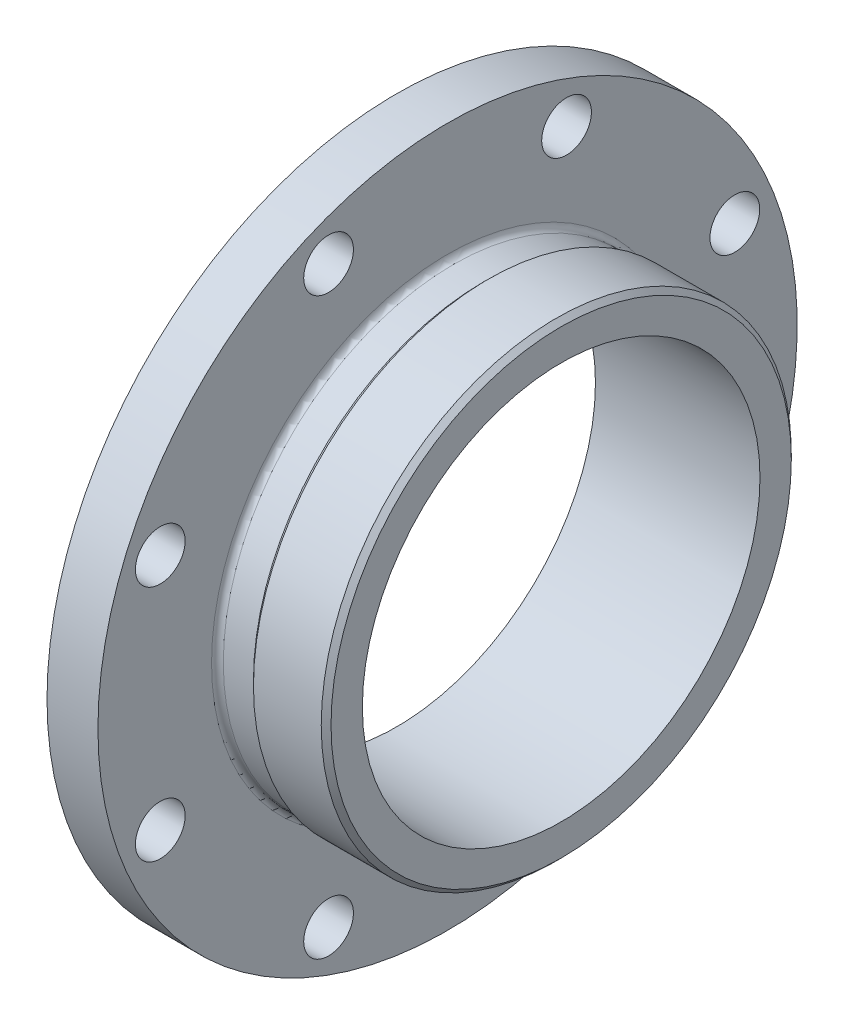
from build123d import *

# Parameters (mm, degrees)
FILLET1_R                         = 3
SKETCH2_R                         = 12.7
F_25_4_MM_HOLE_CUT_EXTRUDE1_DEPTH = 267.046048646
F_25_4MM_HOLES_CIRPATTERN1_COUNT  = 8


with BuildPart() as part:
    # Sketch1 → Revolve1 (revolve)
    with BuildSketch(Plane.XY, mode=Mode.PRIVATE) as revolve1_sk:
        Polygon((26, 178.5), (26, 117.5), (44.4, 117.5), (46.9, 120), (81.5, 120), (84, 117.5), (84, 101.5), (0, 101.5), (0, 178.5), align=None)
    revolve(revolve1_sk.sketch.rotate(Axis((0, 0, 0), (1, 0, 0)), 90), axis=Axis((0, 0, 0), (1, 0, 0)))

    # Fillet1
    fillet1_edges = [part.edges().sort_by_distance(p)[0] for p in [
        (26, 0, -117.5),
    ]]
    fillet(fillet1_edges, radius=FILLET1_R)

    # Sketch2 → 25.4 mm hole Cut-Extrude1 (cut, through all)
    with BuildSketch(Plane.ZY):
        with Locations((60.750994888, 146.665875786)):
            Circle(SKETCH2_R)
    f_25_4_mm_hole_cut_extrude1 = extrude(amount=-F_25_4_MM_HOLE_CUT_EXTRUDE1_DEPTH, mode=Mode.SUBTRACT)

    # 25.4mm holes CirPattern1: 25.4 mm hole Cut-Extrude1 ×8 about axis
    f_25_4mm_holes_cirpattern1_axis = Axis((0, 0, 0), (1, 0, 0))
    for i in range(1, F_25_4MM_HOLES_CIRPATTERN1_COUNT):
        add(f_25_4_mm_hole_cut_extrude1.rotate(f_25_4mm_holes_cirpattern1_axis, i * 360 / F_25_4MM_HOLES_CIRPATTERN1_COUNT), mode=Mode.SUBTRACT)


solid = part.part
